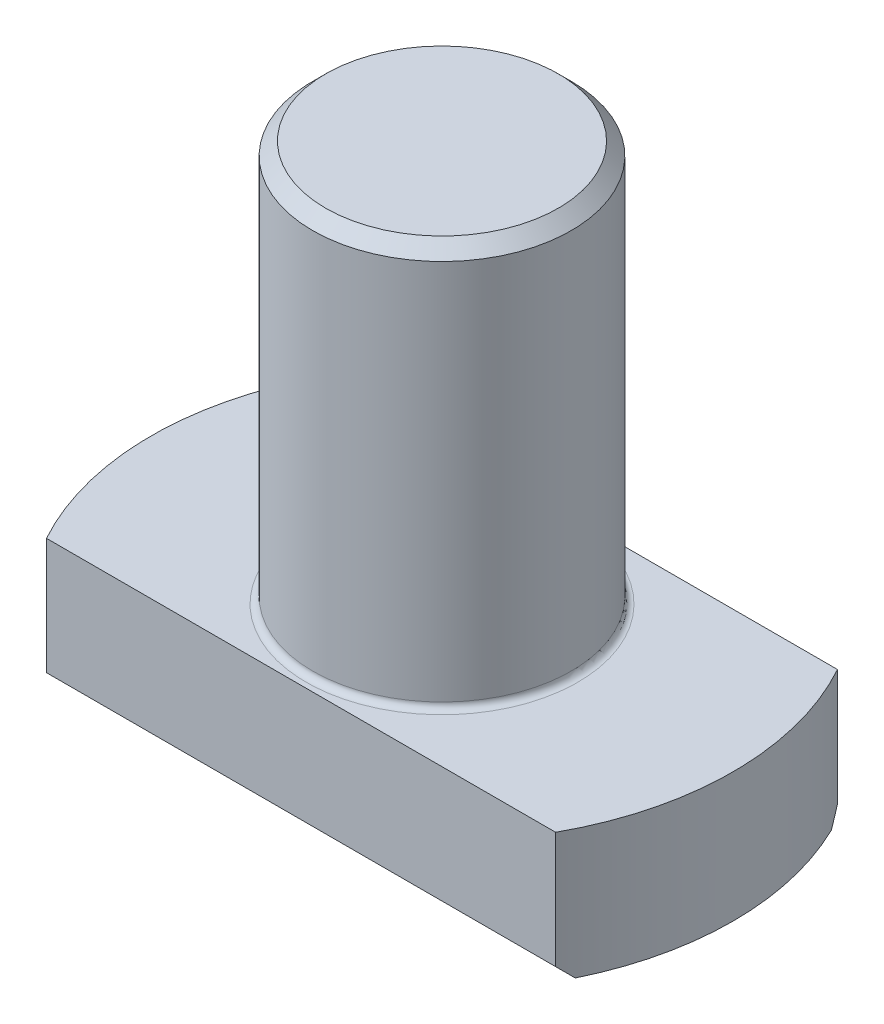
ISO-10303-21;
HEADER;
FILE_DESCRIPTION(('STEP AP214'),'2;1');
FILE_NAME('part.step','',(''),(''),'','','');
FILE_SCHEMA(('AUTOMOTIVE_DESIGN { 1 0 10303 214 1 1 1 1 }'));
ENDSEC;
DATA;
#1=APPLICATION_CONTEXT('core data for automotive mechanical design processes');
#2=APPLICATION_PROTOCOL_DEFINITION('international standard','automotive_design',2000,#1);
#3=PRODUCT_CONTEXT('',#1,'mechanical');
#4=PRODUCT('Part','Part','',(#3));
#5=PRODUCT_RELATED_PRODUCT_CATEGORY('part','',(#4));
#6=PRODUCT_DEFINITION_FORMATION('','',#4);
#7=PRODUCT_DEFINITION_CONTEXT('part definition',#1,'design');
#8=PRODUCT_DEFINITION('design','',#6,#7);
#9=PRODUCT_DEFINITION_SHAPE('','',#8);
#10=(LENGTH_UNIT() NAMED_UNIT(*) SI_UNIT(.MILLI.,.METRE.));
#11=(NAMED_UNIT(*) PLANE_ANGLE_UNIT() SI_UNIT($,.RADIAN.));
#12=(NAMED_UNIT(*) SI_UNIT($,.STERADIAN.) SOLID_ANGLE_UNIT());
#13=UNCERTAINTY_MEASURE_WITH_UNIT(LENGTH_MEASURE(1.E-05),#10,'distance_accuracy_value','');
#14=(GEOMETRIC_REPRESENTATION_CONTEXT(3) GLOBAL_UNCERTAINTY_ASSIGNED_CONTEXT((#13)) GLOBAL_UNIT_ASSIGNED_CONTEXT((#10,
#11,#12)) REPRESENTATION_CONTEXT('',''));
#15=CARTESIAN_POINT('',(0.,0.,0.));
#16=DIRECTION('',(0.,0.,1.));
#17=DIRECTION('',(1.,0.,0.));
#18=AXIS2_PLACEMENT_3D('',#15,#16,#17);
#19=CARTESIAN_POINT('',(0.,31.,0.));
#20=DIRECTION('',(0.,-1.,0.));
#21=DIRECTION('',(0.,0.,-1.));
#22=AXIS2_PLACEMENT_3D('',#19,#20,#21);
#23=CYLINDRICAL_SURFACE('',#22,10.);
#24=CARTESIAN_POINT('',(0.,0.5,0.));
#25=DIRECTION('',(0.,-1.,0.));
#26=DIRECTION('',(0.,0.,-1.));
#27=AXIS2_PLACEMENT_3D('',#24,#25,#26);
#28=CIRCLE('',#27,10.);
#29=CARTESIAN_POINT('',(0.,0.5,-10.));
#30=VERTEX_POINT('',#29);
#31=EDGE_CURVE('E11',#30,#30,#28,.F.);
#32=ORIENTED_EDGE('',*,*,#31,.T.);
#33=EDGE_LOOP('',(#32));
#34=FACE_BOUND('',#33,.T.);
#35=CARTESIAN_POINT('',(0.,30.,0.));
#36=DIRECTION('',(0.,1.,0.));
#37=DIRECTION('',(0.,0.,1.));
#38=AXIS2_PLACEMENT_3D('',#35,#36,#37);
#39=CIRCLE('',#38,10.);
#40=CARTESIAN_POINT('',(0.,30.,10.));
#41=VERTEX_POINT('',#40);
#42=EDGE_CURVE('E129',#41,#41,#39,.F.);
#43=ORIENTED_EDGE('',*,*,#42,.T.);
#44=EDGE_LOOP('',(#43));
#45=FACE_BOUND('',#44,.T.);
#46=ADVANCED_FACE('F35',(#34,#45),#23,.T.);
#47=CARTESIAN_POINT('',(0.,31.,0.));
#48=DIRECTION('',(0.,1.,0.));
#49=DIRECTION('',(0.,0.,1.));
#50=AXIS2_PLACEMENT_3D('',#47,#48,#49);
#51=PLANE('',#50);
#52=CARTESIAN_POINT('',(0.,31.,0.));
#53=DIRECTION('',(0.,1.,0.));
#54=DIRECTION('',(0.,0.,1.));
#55=AXIS2_PLACEMENT_3D('',#52,#53,#54);
#56=CIRCLE('',#55,8.99999999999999);
#57=CARTESIAN_POINT('',(0.,31.,8.99999999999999));
#58=VERTEX_POINT('',#57);
#59=EDGE_CURVE('E99',#58,#58,#56,.T.);
#60=ORIENTED_EDGE('',*,*,#59,.T.);
#61=EDGE_LOOP('',(#60));
#62=FACE_BOUND('',#61,.T.);
#63=ADVANCED_FACE('F160',(#62),#51,.T.);
#64=CARTESIAN_POINT('',(0.,31.,0.));
#65=DIRECTION('',(0.,-1.,0.));
#66=DIRECTION('',(0.,0.,-1.));
#67=AXIS2_PLACEMENT_3D('',#64,#65,#66);
#68=CONICAL_SURFACE('',#67,8.99999999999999,0.785398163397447);
#69=ORIENTED_EDGE('',*,*,#42,.F.);
#70=EDGE_LOOP('',(#69));
#71=FACE_BOUND('',#70,.T.);
#72=ORIENTED_EDGE('',*,*,#59,.F.);
#73=EDGE_LOOP('',(#72));
#74=FACE_BOUND('',#73,.T.);
#75=ADVANCED_FACE('F166',(#71,#74),#68,.T.);
#76=CARTESIAN_POINT('',(0.,0.,0.));
#77=DIRECTION('',(0.,-1.,0.));
#78=DIRECTION('',(0.,0.,-1.));
#79=AXIS2_PLACEMENT_3D('',#76,#77,#78);
#80=PLANE('',#79);
#81=CARTESIAN_POINT('',(0.,0.,0.));
#82=DIRECTION('',(0.,-1.,0.));
#83=DIRECTION('',(0.,0.,-1.));
#84=AXIS2_PLACEMENT_3D('',#81,#82,#83);
#85=CIRCLE('',#84,10.5);
#86=CARTESIAN_POINT('',(0.,0.,-10.5));
#87=VERTEX_POINT('',#86);
#88=EDGE_CURVE('E43',#87,#87,#85,.T.);
#89=ORIENTED_EDGE('',*,*,#88,.T.);
#90=EDGE_LOOP('',(#89));
#91=FACE_BOUND('',#90,.T.);
#92=CARTESIAN_POINT('',(0.,0.,0.));
#93=DIRECTION('',(0.,-1.,0.));
#94=DIRECTION('',(0.,0.,-1.));
#95=AXIS2_PLACEMENT_3D('',#92,#93,#94);
#96=CIRCLE('',#95,22.5);
#97=CARTESIAN_POINT('',(-19.6834956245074,0.,10.9));
#98=VERTEX_POINT('',#97);
#99=CARTESIAN_POINT('',(-19.6834956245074,0.,-10.9));
#100=VERTEX_POINT('',#99);
#101=EDGE_CURVE('E106',#98,#100,#96,.T.);
#102=ORIENTED_EDGE('',*,*,#101,.F.);
#103=DIRECTION('',(-1.,0.,0.));
#104=VECTOR('',#103,1.);
#105=CARTESIAN_POINT('',(-19.6834956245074,0.,10.9));
#106=LINE('',#105,#104);
#107=CARTESIAN_POINT('',(19.6834956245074,0.,10.9));
#108=VERTEX_POINT('',#107);
#109=EDGE_CURVE('E120',#108,#98,#106,.T.);
#110=ORIENTED_EDGE('',*,*,#109,.F.);
#111=CARTESIAN_POINT('',(0.,0.,0.));
#112=DIRECTION('',(0.,-1.,0.));
#113=DIRECTION('',(0.,0.,-1.));
#114=AXIS2_PLACEMENT_3D('',#111,#112,#113);
#115=CIRCLE('',#114,22.5);
#116=CARTESIAN_POINT('',(19.6834956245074,0.,-10.9));
#117=VERTEX_POINT('',#116);
#118=EDGE_CURVE('E108',#117,#108,#115,.T.);
#119=ORIENTED_EDGE('',*,*,#118,.F.);
#120=DIRECTION('',(1.,0.,0.));
#121=VECTOR('',#120,1.);
#122=CARTESIAN_POINT('',(-19.6834956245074,0.,-10.9));
#123=LINE('',#122,#121);
#124=EDGE_CURVE('E92',#100,#117,#123,.T.);
#125=ORIENTED_EDGE('',*,*,#124,.F.);
#126=EDGE_LOOP('',(#102,#110,#119,#125));
#127=FACE_BOUND('',#126,.T.);
#128=ADVANCED_FACE('F104',(#91,#127),#80,.F.);
#129=CARTESIAN_POINT('',(0.,-10.,0.));
#130=DIRECTION('',(0.,1.,0.));
#131=DIRECTION('',(0.,0.,1.));
#132=AXIS2_PLACEMENT_3D('',#129,#130,#131);
#133=CYLINDRICAL_SURFACE('',#132,22.5);
#134=CARTESIAN_POINT('',(0.,-10.,0.));
#135=DIRECTION('',(0.,-1.,0.));
#136=DIRECTION('',(0.,0.,-1.));
#137=AXIS2_PLACEMENT_3D('',#134,#135,#136);
#138=CIRCLE('',#137,22.5);
#139=CARTESIAN_POINT('',(-20.2049498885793,-10.,9.9));
#140=VERTEX_POINT('',#139);
#141=CARTESIAN_POINT('',(-20.2049498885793,-10.,-9.9));
#142=VERTEX_POINT('',#141);
#143=EDGE_CURVE('E122',#140,#142,#138,.T.);
#144=ORIENTED_EDGE('',*,*,#143,.F.);
#145=CARTESIAN_POINT('',(0.,-19.8999999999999,0.));
#146=DIRECTION('',(0.,-0.70710678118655,0.707106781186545));
#147=DIRECTION('',(0.,0.707106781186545,0.70710678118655));
#148=AXIS2_PLACEMENT_3D('',#145,#146,#147);
#149=ELLIPSE('',#148,31.8198051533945,22.5);
#150=CARTESIAN_POINT('',(-19.6834956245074,-9.00000000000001,10.9));
#151=VERTEX_POINT('',#150);
#152=EDGE_CURVE('E140',#140,#151,#149,.F.);
#153=ORIENTED_EDGE('',*,*,#152,.T.);
#154=DIRECTION('',(0.,1.,0.));
#155=VECTOR('',#154,1.);
#156=CARTESIAN_POINT('',(-19.6834956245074,-10.,10.9));
#157=LINE('',#156,#155);
#158=EDGE_CURVE('E112',#151,#98,#157,.T.);
#159=ORIENTED_EDGE('',*,*,#158,.T.);
#160=ORIENTED_EDGE('',*,*,#101,.T.);
#161=DIRECTION('',(0.,1.,0.));
#162=VECTOR('',#161,1.);
#163=CARTESIAN_POINT('',(-19.6834956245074,-10.,-10.9));
#164=LINE('',#163,#162);
#165=CARTESIAN_POINT('',(-19.6834956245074,-9.00000000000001,-10.9));
#166=VERTEX_POINT('',#165);
#167=EDGE_CURVE('E89',#166,#100,#164,.T.);
#168=ORIENTED_EDGE('',*,*,#167,.F.);
#169=CARTESIAN_POINT('',(0.,-19.8999999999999,0.));
#170=DIRECTION('',(0.,-0.70710678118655,-0.707106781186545));
#171=DIRECTION('',(0.,0.707106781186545,-0.70710678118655));
#172=AXIS2_PLACEMENT_3D('',#169,#170,#171);
#173=ELLIPSE('',#172,31.8198051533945,22.5);
#174=EDGE_CURVE('E138',#166,#142,#173,.F.);
#175=ORIENTED_EDGE('',*,*,#174,.T.);
#176=EDGE_LOOP('',(#144,#153,#159,#160,#168,#175));
#177=FACE_BOUND('',#176,.T.);
#178=ADVANCED_FACE('F111',(#177),#133,.T.);
#179=CARTESIAN_POINT('',(-19.6834956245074,-10.,-10.9));
#180=DIRECTION('',(0.,0.,1.));
#181=DIRECTION('',(1.,0.,0.));
#182=AXIS2_PLACEMENT_3D('',#179,#180,#181);
#183=PLANE('',#182);
#184=DIRECTION('',(0.,1.,0.));
#185=VECTOR('',#184,1.);
#186=CARTESIAN_POINT('',(19.6834956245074,-10.,-10.9));
#187=LINE('',#186,#185);
#188=CARTESIAN_POINT('',(19.6834956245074,-9.00000000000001,-10.9));
#189=VERTEX_POINT('',#188);
#190=EDGE_CURVE('E100',#189,#117,#187,.T.);
#191=ORIENTED_EDGE('',*,*,#190,.F.);
#192=DIRECTION('',(-1.,0.,0.));
#193=VECTOR('',#192,1.);
#194=CARTESIAN_POINT('',(-19.6834956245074,-9.00000000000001,-10.9));
#195=LINE('',#194,#193);
#196=EDGE_CURVE('E95',#189,#166,#195,.T.);
#197=ORIENTED_EDGE('',*,*,#196,.T.);
#198=ORIENTED_EDGE('',*,*,#167,.T.);
#199=ORIENTED_EDGE('',*,*,#124,.T.);
#200=EDGE_LOOP('',(#191,#197,#198,#199));
#201=FACE_BOUND('',#200,.T.);
#202=ADVANCED_FACE('F91',(#201),#183,.F.);
#203=CARTESIAN_POINT('',(0.,-10.,0.));
#204=DIRECTION('',(0.,1.,0.));
#205=DIRECTION('',(0.,0.,1.));
#206=AXIS2_PLACEMENT_3D('',#203,#204,#205);
#207=CYLINDRICAL_SURFACE('',#206,22.5);
#208=DIRECTION('',(0.,1.,0.));
#209=VECTOR('',#208,1.);
#210=CARTESIAN_POINT('',(19.6834956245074,-10.,10.9));
#211=LINE('',#210,#209);
#212=CARTESIAN_POINT('',(19.6834956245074,-9.00000000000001,10.9));
#213=VERTEX_POINT('',#212);
#214=EDGE_CURVE('E124',#213,#108,#211,.T.);
#215=ORIENTED_EDGE('',*,*,#214,.F.);
#216=CARTESIAN_POINT('',(0.,-19.8999999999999,0.));
#217=DIRECTION('',(0.,-0.70710678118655,0.707106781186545));
#218=DIRECTION('',(0.,0.707106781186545,0.70710678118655));
#219=AXIS2_PLACEMENT_3D('',#216,#217,#218);
#220=ELLIPSE('',#219,31.8198051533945,22.5);
#221=CARTESIAN_POINT('',(20.2049498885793,-10.,9.9));
#222=VERTEX_POINT('',#221);
#223=EDGE_CURVE('E144',#213,#222,#220,.F.);
#224=ORIENTED_EDGE('',*,*,#223,.T.);
#225=CARTESIAN_POINT('',(0.,-10.,0.));
#226=DIRECTION('',(0.,-1.,0.));
#227=DIRECTION('',(0.,0.,-1.));
#228=AXIS2_PLACEMENT_3D('',#225,#226,#227);
#229=CIRCLE('',#228,22.5);
#230=CARTESIAN_POINT('',(20.2049498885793,-10.,-9.9));
#231=VERTEX_POINT('',#230);
#232=EDGE_CURVE('E116',#231,#222,#229,.T.);
#233=ORIENTED_EDGE('',*,*,#232,.F.);
#234=CARTESIAN_POINT('',(0.,-19.8999999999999,0.));
#235=DIRECTION('',(0.,-0.70710678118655,-0.707106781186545));
#236=DIRECTION('',(0.,0.707106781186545,-0.70710678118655));
#237=AXIS2_PLACEMENT_3D('',#234,#235,#236);
#238=ELLIPSE('',#237,31.8198051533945,22.5);
#239=EDGE_CURVE('E50',#231,#189,#238,.F.);
#240=ORIENTED_EDGE('',*,*,#239,.T.);
#241=ORIENTED_EDGE('',*,*,#190,.T.);
#242=ORIENTED_EDGE('',*,*,#118,.T.);
#243=EDGE_LOOP('',(#215,#224,#233,#240,#241,#242));
#244=FACE_BOUND('',#243,.T.);
#245=ADVANCED_FACE('F187',(#244),#207,.T.);
#246=CARTESIAN_POINT('',(-19.6834956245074,-10.,10.9));
#247=DIRECTION('',(0.,0.,-1.));
#248=DIRECTION('',(-1.,0.,0.));
#249=AXIS2_PLACEMENT_3D('',#246,#247,#248);
#250=PLANE('',#249);
#251=ORIENTED_EDGE('',*,*,#158,.F.);
#252=DIRECTION('',(1.,0.,0.));
#253=VECTOR('',#252,1.);
#254=CARTESIAN_POINT('',(19.6834956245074,-9.00000000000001,10.9));
#255=LINE('',#254,#253);
#256=EDGE_CURVE('E58',#151,#213,#255,.T.);
#257=ORIENTED_EDGE('',*,*,#256,.T.);
#258=ORIENTED_EDGE('',*,*,#214,.T.);
#259=ORIENTED_EDGE('',*,*,#109,.T.);
#260=EDGE_LOOP('',(#251,#257,#258,#259));
#261=FACE_BOUND('',#260,.T.);
#262=ADVANCED_FACE('F181',(#261),#250,.F.);
#263=CARTESIAN_POINT('',(0.,-10.,0.));
#264=DIRECTION('',(0.,-1.,0.));
#265=DIRECTION('',(0.,0.,-1.));
#266=AXIS2_PLACEMENT_3D('',#263,#264,#265);
#267=PLANE('',#266);
#268=ORIENTED_EDGE('',*,*,#232,.T.);
#269=DIRECTION('',(-1.,0.,0.));
#270=VECTOR('',#269,1.);
#271=CARTESIAN_POINT('',(-19.6834956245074,-10.,9.9));
#272=LINE('',#271,#270);
#273=EDGE_CURVE('E135',#222,#140,#272,.T.);
#274=ORIENTED_EDGE('',*,*,#273,.T.);
#275=ORIENTED_EDGE('',*,*,#143,.T.);
#276=DIRECTION('',(1.,0.,0.));
#277=VECTOR('',#276,1.);
#278=CARTESIAN_POINT('',(19.6834956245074,-10.,-9.9));
#279=LINE('',#278,#277);
#280=EDGE_CURVE('E132',#142,#231,#279,.T.);
#281=ORIENTED_EDGE('',*,*,#280,.T.);
#282=EDGE_LOOP('',(#268,#274,#275,#281));
#283=FACE_BOUND('',#282,.T.);
#284=ADVANCED_FACE('F176',(#283),#267,.T.);
#285=CARTESIAN_POINT('',(0.,-10.,9.9));
#286=DIRECTION('',(0.,-0.70710678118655,0.707106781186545));
#287=DIRECTION('',(1.,0.,0.));
#288=AXIS2_PLACEMENT_3D('',#285,#286,#287);
#289=PLANE('',#288);
#290=ORIENTED_EDGE('',*,*,#223,.F.);
#291=ORIENTED_EDGE('',*,*,#256,.F.);
#292=ORIENTED_EDGE('',*,*,#152,.F.);
#293=ORIENTED_EDGE('',*,*,#273,.F.);
#294=EDGE_LOOP('',(#290,#291,#292,#293));
#295=FACE_BOUND('',#294,.T.);
#296=ADVANCED_FACE('F156',(#295),#289,.T.);
#297=CARTESIAN_POINT('',(0.,-10.,-9.9));
#298=DIRECTION('',(0.,-0.70710678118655,-0.707106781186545));
#299=DIRECTION('',(-1.,0.,0.));
#300=AXIS2_PLACEMENT_3D('',#297,#298,#299);
#301=PLANE('',#300);
#302=ORIENTED_EDGE('',*,*,#174,.F.);
#303=ORIENTED_EDGE('',*,*,#196,.F.);
#304=ORIENTED_EDGE('',*,*,#239,.F.);
#305=ORIENTED_EDGE('',*,*,#280,.F.);
#306=EDGE_LOOP('',(#302,#303,#304,#305));
#307=FACE_BOUND('',#306,.T.);
#308=ADVANCED_FACE('F151',(#307),#301,.T.);
#309=CARTESIAN_POINT('',(0.,0.5,0.));
#310=DIRECTION('',(0.,-1.,0.));
#311=DIRECTION('',(0.,0.,-1.));
#312=AXIS2_PLACEMENT_3D('',#309,#310,#311);
#313=TOROIDAL_SURFACE('',#312,10.5,0.5);
#314=ORIENTED_EDGE('',*,*,#31,.F.);
#315=EDGE_LOOP('',(#314));
#316=FACE_BOUND('',#315,.T.);
#317=ORIENTED_EDGE('',*,*,#88,.F.);
#318=EDGE_LOOP('',(#317));
#319=FACE_BOUND('',#318,.T.);
#320=ADVANCED_FACE('F37',(#316,#319),#313,.F.);
#321=CLOSED_SHELL('',(#46,#63,#75,#128,#178,#202,#245,#262,#284,#296,#308,#320));
#322=MANIFOLD_SOLID_BREP('B2',#321);
#323=ADVANCED_BREP_SHAPE_REPRESENTATION('',(#18,#322),#14);
#324=SHAPE_DEFINITION_REPRESENTATION(#9,#323);
ENDSEC;
END-ISO-10303-21;
